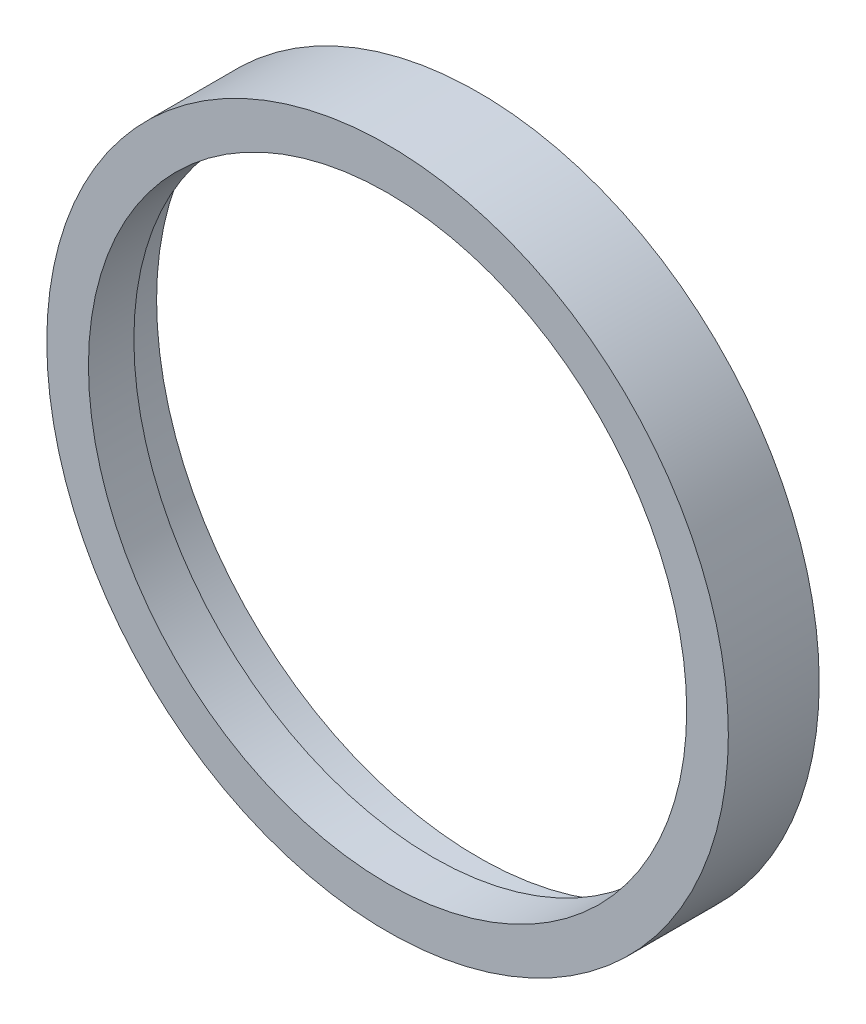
ISO-10303-21;
HEADER;
FILE_DESCRIPTION(('STEP AP214'),'2;1');
FILE_NAME('part.step','',(''),(''),'','','');
FILE_SCHEMA(('AUTOMOTIVE_DESIGN { 1 0 10303 214 1 1 1 1 }'));
ENDSEC;
DATA;
#1=APPLICATION_CONTEXT('core data for automotive mechanical design processes');
#2=APPLICATION_PROTOCOL_DEFINITION('international standard','automotive_design',2000,#1);
#3=PRODUCT_CONTEXT('',#1,'mechanical');
#4=PRODUCT('Part','Part','',(#3));
#5=PRODUCT_RELATED_PRODUCT_CATEGORY('part','',(#4));
#6=PRODUCT_DEFINITION_FORMATION('','',#4);
#7=PRODUCT_DEFINITION_CONTEXT('part definition',#1,'design');
#8=PRODUCT_DEFINITION('design','',#6,#7);
#9=PRODUCT_DEFINITION_SHAPE('','',#8);
#10=(LENGTH_UNIT() NAMED_UNIT(*) SI_UNIT(.MILLI.,.METRE.));
#11=(NAMED_UNIT(*) PLANE_ANGLE_UNIT() SI_UNIT($,.RADIAN.));
#12=(NAMED_UNIT(*) SI_UNIT($,.STERADIAN.) SOLID_ANGLE_UNIT());
#13=UNCERTAINTY_MEASURE_WITH_UNIT(LENGTH_MEASURE(1.E-05),#10,'distance_accuracy_value','');
#14=(GEOMETRIC_REPRESENTATION_CONTEXT(3) GLOBAL_UNCERTAINTY_ASSIGNED_CONTEXT((#13)) GLOBAL_UNIT_ASSIGNED_CONTEXT((#10,
#11,#12)) REPRESENTATION_CONTEXT('',''));
#15=CARTESIAN_POINT('',(0.,0.,0.));
#16=DIRECTION('',(0.,0.,1.));
#17=DIRECTION('',(1.,0.,0.));
#18=AXIS2_PLACEMENT_3D('',#15,#16,#17);
#19=CARTESIAN_POINT('',(0.,0.,0.));
#20=DIRECTION('',(0.,0.,1.));
#21=DIRECTION('',(1.,0.,0.));
#22=AXIS2_PLACEMENT_3D('',#19,#20,#21);
#23=PLANE('',#22);
#24=CARTESIAN_POINT('',(0.,0.,0.));
#25=DIRECTION('',(0.,0.,1.));
#26=DIRECTION('',(1.,0.,0.));
#27=AXIS2_PLACEMENT_3D('',#24,#25,#26);
#28=CIRCLE('',#27,28.575);
#29=CARTESIAN_POINT('',(-28.575,0.,0.));
#30=VERTEX_POINT('',#29);
#31=EDGE_CURVE('E36',#30,#30,#28,.T.);
#32=ORIENTED_EDGE('',*,*,#31,.F.);
#33=EDGE_LOOP('',(#32));
#34=FACE_BOUND('',#33,.T.);
#35=CARTESIAN_POINT('',(0.,0.,0.));
#36=DIRECTION('',(0.,0.,1.));
#37=DIRECTION('',(1.,0.,0.));
#38=AXIS2_PLACEMENT_3D('',#35,#36,#37);
#39=CIRCLE('',#38,26.9875);
#40=CARTESIAN_POINT('',(-26.9875,0.,0.));
#41=VERTEX_POINT('',#40);
#42=EDGE_CURVE('E45',#41,#41,#39,.T.);
#43=ORIENTED_EDGE('',*,*,#42,.T.);
#44=EDGE_LOOP('',(#43));
#45=FACE_BOUND('',#44,.T.);
#46=ADVANCED_FACE('F28',(#34,#45),#23,.F.);
#47=CARTESIAN_POINT('',(0.,0.,7.62));
#48=DIRECTION('',(0.,0.,1.));
#49=DIRECTION('',(1.,0.,0.));
#50=AXIS2_PLACEMENT_3D('',#47,#48,#49);
#51=PLANE('',#50);
#52=CARTESIAN_POINT('',(0.,0.,7.62));
#53=DIRECTION('',(0.,0.,1.));
#54=DIRECTION('',(1.,0.,0.));
#55=AXIS2_PLACEMENT_3D('',#52,#53,#54);
#56=CIRCLE('',#55,28.575);
#57=CARTESIAN_POINT('',(-28.575,0.,7.62));
#58=VERTEX_POINT('',#57);
#59=EDGE_CURVE('E10',#58,#58,#56,.T.);
#60=ORIENTED_EDGE('',*,*,#59,.T.);
#61=EDGE_LOOP('',(#60));
#62=FACE_BOUND('',#61,.T.);
#63=CARTESIAN_POINT('',(0.,0.,7.62));
#64=DIRECTION('',(0.,0.,1.));
#65=DIRECTION('',(1.,0.,0.));
#66=AXIS2_PLACEMENT_3D('',#63,#64,#65);
#67=CIRCLE('',#66,25.0825);
#68=CARTESIAN_POINT('',(-25.0825,0.,7.62));
#69=VERTEX_POINT('',#68);
#70=EDGE_CURVE('E41',#69,#69,#67,.T.);
#71=ORIENTED_EDGE('',*,*,#70,.F.);
#72=EDGE_LOOP('',(#71));
#73=FACE_BOUND('',#72,.T.);
#74=ADVANCED_FACE('F65',(#62,#73),#51,.T.);
#75=CARTESIAN_POINT('',(0.,0.,7.62));
#76=DIRECTION('',(0.,0.,-1.));
#77=DIRECTION('',(-1.,0.,0.));
#78=AXIS2_PLACEMENT_3D('',#75,#76,#77);
#79=CYLINDRICAL_SURFACE('',#78,28.575);
#80=CARTESIAN_POINT('',(-28.575,0.,7.62));
#81=CARTESIAN_POINT('',(-28.575,0.,7.540625));
#82=CARTESIAN_POINT('',(-28.575,0.,7.46125));
#83=CARTESIAN_POINT('',(-28.575,0.,7.3025));
#84=CARTESIAN_POINT('',(-28.575,0.,7.223125));
#85=CARTESIAN_POINT('',(-28.575,0.,7.064375));
#86=CARTESIAN_POINT('',(-28.575,0.,6.985));
#87=CARTESIAN_POINT('',(-28.575,0.,6.82625));
#88=CARTESIAN_POINT('',(-28.575,0.,6.746875));
#89=CARTESIAN_POINT('',(-28.575,0.,6.588125));
#90=CARTESIAN_POINT('',(-28.575,0.,6.50875));
#91=CARTESIAN_POINT('',(-28.575,0.,6.35));
#92=CARTESIAN_POINT('',(-28.575,0.,6.270625));
#93=CARTESIAN_POINT('',(-28.575,0.,6.111875));
#94=CARTESIAN_POINT('',(-28.575,0.,6.0325));
#95=CARTESIAN_POINT('',(-28.575,0.,5.87375));
#96=CARTESIAN_POINT('',(-28.575,0.,5.794375));
#97=CARTESIAN_POINT('',(-28.575,0.,5.635625));
#98=CARTESIAN_POINT('',(-28.575,0.,5.55625));
#99=CARTESIAN_POINT('',(-28.575,0.,5.3975));
#100=CARTESIAN_POINT('',(-28.575,0.,5.318125));
#101=CARTESIAN_POINT('',(-28.575,0.,5.159375));
#102=CARTESIAN_POINT('',(-28.575,0.,5.08));
#103=CARTESIAN_POINT('',(-28.575,0.,4.92125));
#104=CARTESIAN_POINT('',(-28.575,0.,4.841875));
#105=CARTESIAN_POINT('',(-28.575,0.,4.683125));
#106=CARTESIAN_POINT('',(-28.575,0.,4.60375));
#107=CARTESIAN_POINT('',(-28.575,0.,4.445));
#108=CARTESIAN_POINT('',(-28.575,0.,4.365625));
#109=CARTESIAN_POINT('',(-28.575,0.,4.206875));
#110=CARTESIAN_POINT('',(-28.575,0.,4.1275));
#111=CARTESIAN_POINT('',(-28.575,0.,3.96875));
#112=CARTESIAN_POINT('',(-28.575,0.,3.889375));
#113=CARTESIAN_POINT('',(-28.575,0.,3.730625));
#114=CARTESIAN_POINT('',(-28.575,0.,3.65125));
#115=CARTESIAN_POINT('',(-28.575,0.,3.4925));
#116=CARTESIAN_POINT('',(-28.575,0.,3.413125));
#117=CARTESIAN_POINT('',(-28.575,0.,3.254375));
#118=CARTESIAN_POINT('',(-28.575,0.,3.175));
#119=CARTESIAN_POINT('',(-28.575,0.,3.01625));
#120=CARTESIAN_POINT('',(-28.575,0.,2.936875));
#121=CARTESIAN_POINT('',(-28.575,0.,2.778125));
#122=CARTESIAN_POINT('',(-28.575,0.,2.69875));
#123=CARTESIAN_POINT('',(-28.575,0.,2.54));
#124=CARTESIAN_POINT('',(-28.575,0.,2.460625));
#125=CARTESIAN_POINT('',(-28.575,0.,2.301875));
#126=CARTESIAN_POINT('',(-28.575,0.,2.2225));
#127=CARTESIAN_POINT('',(-28.575,0.,2.06375));
#128=CARTESIAN_POINT('',(-28.575,0.,1.984375));
#129=CARTESIAN_POINT('',(-28.575,0.,1.825625));
#130=CARTESIAN_POINT('',(-28.575,0.,1.74625));
#131=CARTESIAN_POINT('',(-28.575,0.,1.5875));
#132=CARTESIAN_POINT('',(-28.575,0.,1.508125));
#133=CARTESIAN_POINT('',(-28.575,0.,1.349375));
#134=CARTESIAN_POINT('',(-28.575,0.,1.27));
#135=CARTESIAN_POINT('',(-28.575,0.,1.11125));
#136=CARTESIAN_POINT('',(-28.575,0.,1.031875));
#137=CARTESIAN_POINT('',(-28.575,0.,0.873125));
#138=CARTESIAN_POINT('',(-28.575,0.,0.79375));
#139=CARTESIAN_POINT('',(-28.575,0.,0.635));
#140=CARTESIAN_POINT('',(-28.575,0.,0.555625));
#141=CARTESIAN_POINT('',(-28.575,0.,0.396875));
#142=CARTESIAN_POINT('',(-28.575,0.,0.3175));
#143=CARTESIAN_POINT('',(-28.575,0.,0.15875));
#144=CARTESIAN_POINT('',(-28.575,0.,0.0793749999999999));
#145=CARTESIAN_POINT('',(-28.575,0.,0.));
#146=B_SPLINE_CURVE_WITH_KNOTS('',3,(#80,#81,#82,#83,#84,#85,#86,#87,#88,#89,#90,#91,#92,#93,
#94,#95,#96,#97,#98,#99,#100,#101,#102,#103,#104,#105,#106,#107,#108,#109,#110,#111,#112,#113,
#114,#115,#116,#117,#118,#119,#120,#121,#122,#123,#124,#125,#126,#127,#128,#129,#130,#131,#132,
#133,#134,#135,#136,#137,#138,#139,#140,#141,#142,#143,#144,#145),.UNSPECIFIED.,.F.,.F.,(4,2,2,
2,2,2,2,2,2,2,2,2,2,2,2,2,2,2,2,2,2,2,2,2,2,2,2,2,2,2,2,2,4),(0.,0.238125,0.47625,
0.714375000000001,0.9525,1.190625,1.42875,1.666875,1.905,2.143125,2.38125,2.619375,2.8575,
3.095625,3.33375,3.571875,3.81,4.048125,4.28625,4.524375,4.7625,5.000625,5.23875,5.476875,5.715,
5.953125,6.19125,6.429375,6.6675,6.905625,7.14375,7.381875,7.62),.UNSPECIFIED.);
#147=EDGE_CURVE('BSEAM30',#58,#30,#146,.T.);
#148=ORIENTED_EDGE('',*,*,#59,.F.);
#149=ORIENTED_EDGE('',*,*,#31,.T.);
#150=ORIENTED_EDGE('',*,*,#147,.T.);
#151=ORIENTED_EDGE('',*,*,#147,.F.);
#152=EDGE_LOOP('',(#148,#150,#149,#151));
#153=FACE_BOUND('',#152,.T.);
#154=ADVANCED_FACE('F30',(#153),#79,.T.);
#155=CARTESIAN_POINT('',(0.,0.,7.62));
#156=DIRECTION('',(0.,0.,-1.));
#157=DIRECTION('',(-1.,0.,0.));
#158=AXIS2_PLACEMENT_3D('',#155,#156,#157);
#159=CYLINDRICAL_SURFACE('',#158,25.0825);
#160=CARTESIAN_POINT('',(0.,0.,3.81));
#161=DIRECTION('',(0.,0.,1.));
#162=DIRECTION('',(1.,0.,0.));
#163=AXIS2_PLACEMENT_3D('',#160,#161,#162);
#164=CIRCLE('',#163,25.0825);
#165=CARTESIAN_POINT('',(-25.0825,0.,3.81));
#166=VERTEX_POINT('',#165);
#167=EDGE_CURVE('E32',#166,#166,#164,.T.);
#168=CARTESIAN_POINT('',(-25.0825,0.,3.81));
#169=CARTESIAN_POINT('',(-25.0825,0.,3.8496875));
#170=CARTESIAN_POINT('',(-25.0825,0.,3.889375));
#171=CARTESIAN_POINT('',(-25.0825,0.,3.96875));
#172=CARTESIAN_POINT('',(-25.0825,0.,4.0084375));
#173=CARTESIAN_POINT('',(-25.0825,0.,4.0878125));
#174=CARTESIAN_POINT('',(-25.0825,0.,4.1275));
#175=CARTESIAN_POINT('',(-25.0825,0.,4.206875));
#176=CARTESIAN_POINT('',(-25.0825,0.,4.2465625));
#177=CARTESIAN_POINT('',(-25.0825,0.,4.3259375));
#178=CARTESIAN_POINT('',(-25.0825,0.,4.365625));
#179=CARTESIAN_POINT('',(-25.0825,0.,4.445));
#180=CARTESIAN_POINT('',(-25.0825,0.,4.4846875));
#181=CARTESIAN_POINT('',(-25.0825,0.,4.5640625));
#182=CARTESIAN_POINT('',(-25.0825,0.,4.60375));
#183=CARTESIAN_POINT('',(-25.0825,0.,4.683125));
#184=CARTESIAN_POINT('',(-25.0825,0.,4.7228125));
#185=CARTESIAN_POINT('',(-25.0825,0.,4.8021875));
#186=CARTESIAN_POINT('',(-25.0825,0.,4.841875));
#187=CARTESIAN_POINT('',(-25.0825,0.,4.92125));
#188=CARTESIAN_POINT('',(-25.0825,0.,4.9609375));
#189=CARTESIAN_POINT('',(-25.0825,0.,5.0403125));
#190=CARTESIAN_POINT('',(-25.0825,0.,5.08));
#191=CARTESIAN_POINT('',(-25.0825,0.,5.159375));
#192=CARTESIAN_POINT('',(-25.0825,0.,5.1990625));
#193=CARTESIAN_POINT('',(-25.0825,0.,5.2784375));
#194=CARTESIAN_POINT('',(-25.0825,0.,5.318125));
#195=CARTESIAN_POINT('',(-25.0825,0.,5.3975));
#196=CARTESIAN_POINT('',(-25.0825,0.,5.4371875));
#197=CARTESIAN_POINT('',(-25.0825,0.,5.5165625));
#198=CARTESIAN_POINT('',(-25.0825,0.,5.55625));
#199=CARTESIAN_POINT('',(-25.0825,0.,5.635625));
#200=CARTESIAN_POINT('',(-25.0825,0.,5.6753125));
#201=CARTESIAN_POINT('',(-25.0825,0.,5.7546875));
#202=CARTESIAN_POINT('',(-25.0825,0.,5.794375));
#203=CARTESIAN_POINT('',(-25.0825,0.,5.87375));
#204=CARTESIAN_POINT('',(-25.0825,0.,5.9134375));
#205=CARTESIAN_POINT('',(-25.0825,0.,5.9928125));
#206=CARTESIAN_POINT('',(-25.0825,0.,6.0325));
#207=CARTESIAN_POINT('',(-25.0825,0.,6.111875));
#208=CARTESIAN_POINT('',(-25.0825,0.,6.1515625));
#209=CARTESIAN_POINT('',(-25.0825,0.,6.2309375));
#210=CARTESIAN_POINT('',(-25.0825,0.,6.270625));
#211=CARTESIAN_POINT('',(-25.0825,0.,6.35));
#212=CARTESIAN_POINT('',(-25.0825,0.,6.3896875));
#213=CARTESIAN_POINT('',(-25.0825,0.,6.4690625));
#214=CARTESIAN_POINT('',(-25.0825,0.,6.50875));
#215=CARTESIAN_POINT('',(-25.0825,0.,6.588125));
#216=CARTESIAN_POINT('',(-25.0825,0.,6.6278125));
#217=CARTESIAN_POINT('',(-25.0825,0.,6.7071875));
#218=CARTESIAN_POINT('',(-25.0825,0.,6.746875));
#219=CARTESIAN_POINT('',(-25.0825,0.,6.82625));
#220=CARTESIAN_POINT('',(-25.0825,0.,6.8659375));
#221=CARTESIAN_POINT('',(-25.0825,0.,6.9453125));
#222=CARTESIAN_POINT('',(-25.0825,0.,6.985));
#223=CARTESIAN_POINT('',(-25.0825,0.,7.064375));
#224=CARTESIAN_POINT('',(-25.0825,0.,7.1040625));
#225=CARTESIAN_POINT('',(-25.0825,0.,7.1834375));
#226=CARTESIAN_POINT('',(-25.0825,0.,7.223125));
#227=CARTESIAN_POINT('',(-25.0825,0.,7.3025));
#228=CARTESIAN_POINT('',(-25.0825,0.,7.3421875));
#229=CARTESIAN_POINT('',(-25.0825,0.,7.4215625));
#230=CARTESIAN_POINT('',(-25.0825,0.,7.46125));
#231=CARTESIAN_POINT('',(-25.0825,0.,7.540625));
#232=CARTESIAN_POINT('',(-25.0825,0.,7.5803125));
#233=CARTESIAN_POINT('',(-25.0825,0.,7.62));
#234=B_SPLINE_CURVE_WITH_KNOTS('',3,(#168,#169,#170,#171,#172,#173,#174,#175,#176,#177,#178,
#179,#180,#181,#182,#183,#184,#185,#186,#187,#188,#189,#190,#191,#192,#193,#194,#195,#196,#197,
#198,#199,#200,#201,#202,#203,#204,#205,#206,#207,#208,#209,#210,#211,#212,#213,#214,#215,#216,
#217,#218,#219,#220,#221,#222,#223,#224,#225,#226,#227,#228,#229,#230,#231,#232,#233),
.UNSPECIFIED.,.F.,.F.,(4,2,2,2,2,2,2,2,2,2,2,2,2,2,2,2,2,2,2,2,2,2,2,2,2,2,2,2,2,2,2,2,4),(0.,
0.1190625,0.238125,0.357187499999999,0.476250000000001,0.5953125,0.714374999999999,0.8334375,
0.9525,1.0715625,1.190625,1.3096875,1.42875,1.5478125,1.666875,1.7859375,1.905,2.0240625,
2.143125,2.2621875,2.38125,2.5003125,2.619375,2.7384375,2.8575,2.9765625,3.095625,3.2146875,
3.33375,3.4528125,3.571875,3.6909375,3.81),.UNSPECIFIED.);
#235=EDGE_CURVE('BSEAM58',#166,#69,#234,.T.);
#236=ORIENTED_EDGE('',*,*,#167,.F.);
#237=ORIENTED_EDGE('',*,*,#70,.T.);
#238=ORIENTED_EDGE('',*,*,#235,.T.);
#239=ORIENTED_EDGE('',*,*,#235,.F.);
#240=EDGE_LOOP('',(#236,#238,#237,#239));
#241=FACE_BOUND('',#240,.T.);
#242=ADVANCED_FACE('F58',(#241),#159,.F.);
#243=CARTESIAN_POINT('',(0.,0.,3.81));
#244=DIRECTION('',(0.,0.,-1.));
#245=DIRECTION('',(-1.,0.,0.));
#246=AXIS2_PLACEMENT_3D('',#243,#244,#245);
#247=CYLINDRICAL_SURFACE('',#246,26.9875);
#248=CARTESIAN_POINT('',(0.,0.,3.81));
#249=DIRECTION('',(0.,0.,1.));
#250=DIRECTION('',(1.,0.,0.));
#251=AXIS2_PLACEMENT_3D('',#248,#249,#250);
#252=CIRCLE('',#251,26.9875);
#253=CARTESIAN_POINT('',(-26.9875,0.,3.81));
#254=VERTEX_POINT('',#253);
#255=EDGE_CURVE('E48',#254,#254,#252,.T.);
#256=CARTESIAN_POINT('',(-26.9875,0.,3.81));
#257=CARTESIAN_POINT('',(-26.9875,0.,3.7703125));
#258=CARTESIAN_POINT('',(-26.9875,0.,3.730625));
#259=CARTESIAN_POINT('',(-26.9875,0.,3.65125));
#260=CARTESIAN_POINT('',(-26.9875,0.,3.6115625));
#261=CARTESIAN_POINT('',(-26.9875,0.,3.5321875));
#262=CARTESIAN_POINT('',(-26.9875,0.,3.4925));
#263=CARTESIAN_POINT('',(-26.9875,0.,3.413125));
#264=CARTESIAN_POINT('',(-26.9875,0.,3.3734375));
#265=CARTESIAN_POINT('',(-26.9875,0.,3.2940625));
#266=CARTESIAN_POINT('',(-26.9875,0.,3.254375));
#267=CARTESIAN_POINT('',(-26.9875,0.,3.175));
#268=CARTESIAN_POINT('',(-26.9875,0.,3.1353125));
#269=CARTESIAN_POINT('',(-26.9875,0.,3.0559375));
#270=CARTESIAN_POINT('',(-26.9875,0.,3.01625));
#271=CARTESIAN_POINT('',(-26.9875,0.,2.936875));
#272=CARTESIAN_POINT('',(-26.9875,0.,2.8971875));
#273=CARTESIAN_POINT('',(-26.9875,0.,2.8178125));
#274=CARTESIAN_POINT('',(-26.9875,0.,2.778125));
#275=CARTESIAN_POINT('',(-26.9875,0.,2.69875));
#276=CARTESIAN_POINT('',(-26.9875,0.,2.6590625));
#277=CARTESIAN_POINT('',(-26.9875,0.,2.5796875));
#278=CARTESIAN_POINT('',(-26.9875,0.,2.54));
#279=CARTESIAN_POINT('',(-26.9875,0.,2.460625));
#280=CARTESIAN_POINT('',(-26.9875,0.,2.4209375));
#281=CARTESIAN_POINT('',(-26.9875,0.,2.3415625));
#282=CARTESIAN_POINT('',(-26.9875,0.,2.301875));
#283=CARTESIAN_POINT('',(-26.9875,0.,2.2225));
#284=CARTESIAN_POINT('',(-26.9875,0.,2.1828125));
#285=CARTESIAN_POINT('',(-26.9875,0.,2.1034375));
#286=CARTESIAN_POINT('',(-26.9875,0.,2.06375));
#287=CARTESIAN_POINT('',(-26.9875,0.,1.984375));
#288=CARTESIAN_POINT('',(-26.9875,0.,1.9446875));
#289=CARTESIAN_POINT('',(-26.9875,0.,1.8653125));
#290=CARTESIAN_POINT('',(-26.9875,0.,1.825625));
#291=CARTESIAN_POINT('',(-26.9875,0.,1.74625));
#292=CARTESIAN_POINT('',(-26.9875,0.,1.7065625));
#293=CARTESIAN_POINT('',(-26.9875,0.,1.6271875));
#294=CARTESIAN_POINT('',(-26.9875,0.,1.5875));
#295=CARTESIAN_POINT('',(-26.9875,0.,1.508125));
#296=CARTESIAN_POINT('',(-26.9875,0.,1.4684375));
#297=CARTESIAN_POINT('',(-26.9875,0.,1.3890625));
#298=CARTESIAN_POINT('',(-26.9875,0.,1.349375));
#299=CARTESIAN_POINT('',(-26.9875,0.,1.27));
#300=CARTESIAN_POINT('',(-26.9875,0.,1.2303125));
#301=CARTESIAN_POINT('',(-26.9875,0.,1.1509375));
#302=CARTESIAN_POINT('',(-26.9875,0.,1.11125));
#303=CARTESIAN_POINT('',(-26.9875,0.,1.031875));
#304=CARTESIAN_POINT('',(-26.9875,0.,0.9921875));
#305=CARTESIAN_POINT('',(-26.9875,0.,0.9128125));
#306=CARTESIAN_POINT('',(-26.9875,0.,0.873125));
#307=CARTESIAN_POINT('',(-26.9875,0.,0.79375));
#308=CARTESIAN_POINT('',(-26.9875,0.,0.7540625));
#309=CARTESIAN_POINT('',(-26.9875,0.,0.6746875));
#310=CARTESIAN_POINT('',(-26.9875,0.,0.635));
#311=CARTESIAN_POINT('',(-26.9875,0.,0.555625));
#312=CARTESIAN_POINT('',(-26.9875,0.,0.5159375));
#313=CARTESIAN_POINT('',(-26.9875,0.,0.4365625));
#314=CARTESIAN_POINT('',(-26.9875,0.,0.396875));
#315=CARTESIAN_POINT('',(-26.9875,0.,0.3175));
#316=CARTESIAN_POINT('',(-26.9875,0.,0.2778125));
#317=CARTESIAN_POINT('',(-26.9875,0.,0.1984375));
#318=CARTESIAN_POINT('',(-26.9875,0.,0.15875));
#319=CARTESIAN_POINT('',(-26.9875,0.,0.0793749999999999));
#320=CARTESIAN_POINT('',(-26.9875,0.,0.0396874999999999));
#321=CARTESIAN_POINT('',(-26.9875,0.,0.));
#322=B_SPLINE_CURVE_WITH_KNOTS('',3,(#256,#257,#258,#259,#260,#261,#262,#263,#264,#265,#266,
#267,#268,#269,#270,#271,#272,#273,#274,#275,#276,#277,#278,#279,#280,#281,#282,#283,#284,#285,
#286,#287,#288,#289,#290,#291,#292,#293,#294,#295,#296,#297,#298,#299,#300,#301,#302,#303,#304,
#305,#306,#307,#308,#309,#310,#311,#312,#313,#314,#315,#316,#317,#318,#319,#320,#321),
.UNSPECIFIED.,.F.,.F.,(4,2,2,2,2,2,2,2,2,2,2,2,2,2,2,2,2,2,2,2,2,2,2,2,2,2,2,2,2,2,2,2,4),(0.,
0.1190625,0.238125,0.3571875,0.47625,0.5953125,0.714375,0.8334375,0.9525,1.0715625,1.190625,
1.3096875,1.42875,1.5478125,1.666875,1.7859375,1.905,2.0240625,2.143125,2.2621875,2.38125,
2.5003125,2.619375,2.7384375,2.8575,2.9765625,3.095625,3.2146875,3.33375,3.4528125,3.571875,
3.6909375,3.81),.UNSPECIFIED.);
#323=EDGE_CURVE('BSEAM61',#254,#41,#322,.T.);
#324=ORIENTED_EDGE('',*,*,#255,.T.);
#325=ORIENTED_EDGE('',*,*,#42,.F.);
#326=ORIENTED_EDGE('',*,*,#323,.T.);
#327=ORIENTED_EDGE('',*,*,#323,.F.);
#328=EDGE_LOOP('',(#324,#326,#325,#327));
#329=FACE_BOUND('',#328,.T.);
#330=ADVANCED_FACE('F61',(#329),#247,.F.);
#331=CARTESIAN_POINT('',(0.,0.,3.81));
#332=DIRECTION('',(0.,0.,1.));
#333=DIRECTION('',(1.,0.,0.));
#334=AXIS2_PLACEMENT_3D('',#331,#332,#333);
#335=PLANE('',#334);
#336=ORIENTED_EDGE('',*,*,#167,.T.);
#337=EDGE_LOOP('',(#336));
#338=FACE_BOUND('',#337,.T.);
#339=ORIENTED_EDGE('',*,*,#255,.F.);
#340=EDGE_LOOP('',(#339));
#341=FACE_BOUND('',#340,.T.);
#342=ADVANCED_FACE('F55',(#338,#341),#335,.F.);
#343=CLOSED_SHELL('',(#46,#74,#154,#242,#330,#342));
#344=MANIFOLD_SOLID_BREP('B2',#343);
#345=ADVANCED_BREP_SHAPE_REPRESENTATION('',(#18,#344),#14);
#346=SHAPE_DEFINITION_REPRESENTATION(#9,#345);
ENDSEC;
END-ISO-10303-21;
